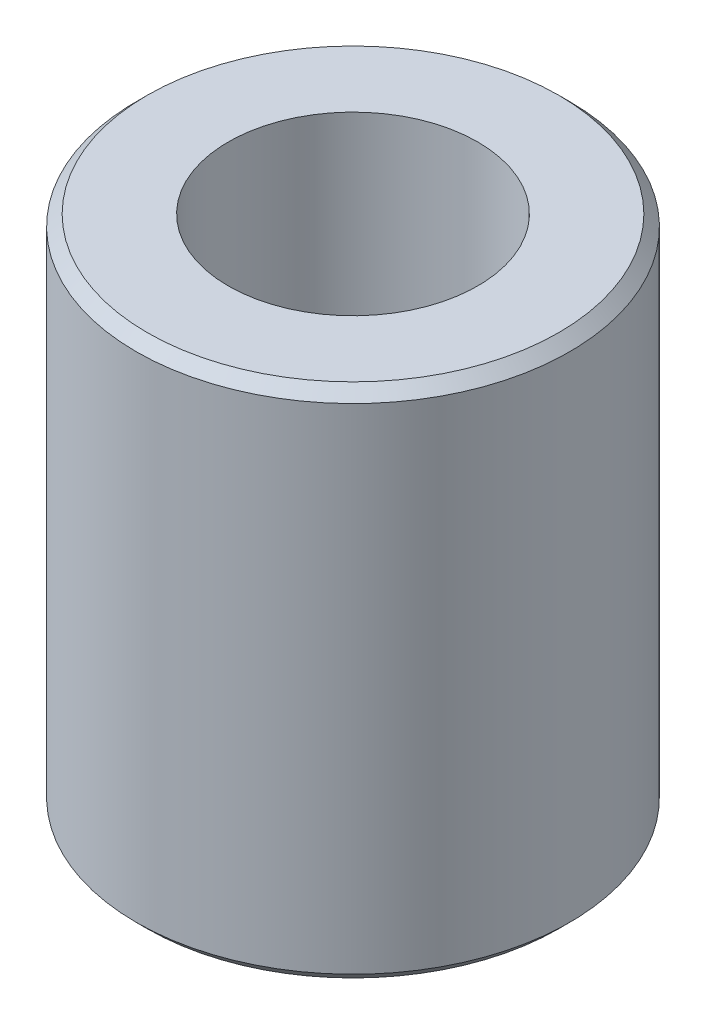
ISO-10303-21;
HEADER;
FILE_DESCRIPTION(('STEP AP214'),'2;1');
FILE_NAME('part.step','',(''),(''),'','','');
FILE_SCHEMA(('AUTOMOTIVE_DESIGN { 1 0 10303 214 1 1 1 1 }'));
ENDSEC;
DATA;
#1=APPLICATION_CONTEXT('core data for automotive mechanical design processes');
#2=APPLICATION_PROTOCOL_DEFINITION('international standard','automotive_design',2000,#1);
#3=PRODUCT_CONTEXT('',#1,'mechanical');
#4=PRODUCT('Part','Part','',(#3));
#5=PRODUCT_RELATED_PRODUCT_CATEGORY('part','',(#4));
#6=PRODUCT_DEFINITION_FORMATION('','',#4);
#7=PRODUCT_DEFINITION_CONTEXT('part definition',#1,'design');
#8=PRODUCT_DEFINITION('design','',#6,#7);
#9=PRODUCT_DEFINITION_SHAPE('','',#8);
#10=(LENGTH_UNIT() NAMED_UNIT(*) SI_UNIT(.MILLI.,.METRE.));
#11=(NAMED_UNIT(*) PLANE_ANGLE_UNIT() SI_UNIT($,.RADIAN.));
#12=(NAMED_UNIT(*) SI_UNIT($,.STERADIAN.) SOLID_ANGLE_UNIT());
#13=UNCERTAINTY_MEASURE_WITH_UNIT(LENGTH_MEASURE(1.E-05),#10,'distance_accuracy_value','');
#14=(GEOMETRIC_REPRESENTATION_CONTEXT(3) GLOBAL_UNCERTAINTY_ASSIGNED_CONTEXT((#13)) GLOBAL_UNIT_ASSIGNED_CONTEXT((#10,
#11,#12)) REPRESENTATION_CONTEXT('',''));
#15=CARTESIAN_POINT('',(0.,0.,0.));
#16=DIRECTION('',(0.,0.,1.));
#17=DIRECTION('',(1.,0.,0.));
#18=AXIS2_PLACEMENT_3D('',#15,#16,#17);
#19=CARTESIAN_POINT('',(0.,4.86357961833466,0.));
#20=DIRECTION('',(0.,1.,0.));
#21=DIRECTION('',(0.,0.,1.));
#22=AXIS2_PLACEMENT_3D('',#19,#20,#21);
#23=CYLINDRICAL_SURFACE('',#22,7.14375);
#24=CARTESIAN_POINT('',(0.,-11.1125,0.));
#25=DIRECTION('',(0.,1.,0.));
#26=DIRECTION('',(0.,0.,1.));
#27=AXIS2_PLACEMENT_3D('',#24,#25,#26);
#28=CIRCLE('',#27,7.14375);
#29=CARTESIAN_POINT('',(0.,-11.1125,7.14375));
#30=VERTEX_POINT('',#29);
#31=EDGE_CURVE('E207',#30,#30,#28,.T.);
#32=ORIENTED_EDGE('',*,*,#31,.T.);
#33=EDGE_LOOP('',(#32));
#34=FACE_BOUND('',#33,.T.);
#35=CARTESIAN_POINT('',(0.,-12.6873,0.));
#36=DIRECTION('',(0.,-1.,0.));
#37=DIRECTION('',(0.,0.,-1.));
#38=AXIS2_PLACEMENT_3D('',#35,#36,#37);
#39=CIRCLE('',#38,7.14375);
#40=CARTESIAN_POINT('',(0.,-12.6873,-7.14375));
#41=VERTEX_POINT('',#40);
#42=CARTESIAN_POINT('',(-6.18666897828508,-12.6873,-3.571875));
#43=VERTEX_POINT('',#42);
#44=EDGE_CURVE('E276',#41,#43,#39,.F.);
#45=ORIENTED_EDGE('',*,*,#44,.F.);
#46=CARTESIAN_POINT('',(6.18666897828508,-12.6873,-3.57187499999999));
#47=VERTEX_POINT('',#46);
#48=EDGE_CURVE('E54',#47,#41,#39,.F.);
#49=ORIENTED_EDGE('',*,*,#48,.F.);
#50=CARTESIAN_POINT('',(6.18666897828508,-12.6873,3.571875));
#51=VERTEX_POINT('',#50);
#52=EDGE_CURVE('E147',#51,#47,#39,.F.);
#53=ORIENTED_EDGE('',*,*,#52,.F.);
#54=CARTESIAN_POINT('',(0.,-12.6873,7.14375));
#55=VERTEX_POINT('',#54);
#56=EDGE_CURVE('E335',#55,#51,#39,.F.);
#57=ORIENTED_EDGE('',*,*,#56,.F.);
#58=CARTESIAN_POINT('',(-6.18666897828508,-12.6873,3.57187499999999));
#59=VERTEX_POINT('',#58);
#60=EDGE_CURVE('E332',#59,#55,#39,.F.);
#61=ORIENTED_EDGE('',*,*,#60,.F.);
#62=EDGE_CURVE('E329',#43,#59,#39,.F.);
#63=ORIENTED_EDGE('',*,*,#62,.F.);
#64=EDGE_LOOP('',(#45,#49,#53,#57,#61,#63));
#65=FACE_BOUND('',#64,.T.);
#66=ADVANCED_FACE('F35',(#34,#65),#23,.F.);
#67=CARTESIAN_POINT('',(0.,-23.8125,0.));
#68=DIRECTION('',(0.,-1.,0.));
#69=DIRECTION('',(0.,0.,-1.));
#70=AXIS2_PLACEMENT_3D('',#67,#68,#69);
#71=CONICAL_SURFACE('',#70,8.15975,0.785398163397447);
#72=CARTESIAN_POINT('',(4.21489186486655,-23.8127000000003,-6.98709314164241));
#73=CARTESIAN_POINT('',(4.28318413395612,-23.7467000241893,-6.86880746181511));
#74=CARTESIAN_POINT('',(4.35198830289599,-23.6828153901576,-6.74963514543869));
#75=CARTESIAN_POINT('',(4.4907083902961,-23.5598853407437,-6.50936490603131));
#76=CARTESIAN_POINT('',(4.56062484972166,-23.5008423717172,-6.38826604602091));
#77=CARTESIAN_POINT('',(4.77273544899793,-23.3314558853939,-6.02087971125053));
#78=CARTESIAN_POINT('',(4.91664778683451,-23.2294895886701,-5.77161623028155));
#79=CARTESIAN_POINT('',(5.20678485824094,-23.0553604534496,-5.26908408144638));
#80=CARTESIAN_POINT('',(5.35294684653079,-22.9827912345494,-5.01592409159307));
#81=CARTESIAN_POINT('',(5.57439985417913,-22.8992395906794,-4.63235623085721));
#82=CARTESIAN_POINT('',(5.64852180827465,-22.8756154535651,-4.50397324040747));
#83=CARTESIAN_POINT('',(5.79733557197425,-22.8372971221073,-4.24622024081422));
#84=CARTESIAN_POINT('',(5.87202731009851,-22.8226018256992,-4.11685035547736));
#85=CARTESIAN_POINT('',(6.0585174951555,-22.7976320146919,-3.79383987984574));
#86=CARTESIAN_POINT('',(6.170521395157,-22.7930745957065,-3.59984343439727));
#87=CARTESIAN_POINT('',(6.394269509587,-22.8050554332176,-3.21230033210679));
#88=CARTESIAN_POINT('',(6.50601362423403,-22.8216007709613,-3.01875384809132));
#89=CARTESIAN_POINT('',(6.728384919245,-22.8748115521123,-2.63359546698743));
#90=CARTESIAN_POINT('',(6.83901095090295,-22.9114958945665,-2.44198555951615));
#91=CARTESIAN_POINT('',(7.05833575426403,-23.0030104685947,-2.0621038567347));
#92=CARTESIAN_POINT('',(7.1670346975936,-23.0578390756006,-1.87383176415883));
#93=CARTESIAN_POINT('',(7.3507423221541,-23.164884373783,-1.55564082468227));
#94=CARTESIAN_POINT('',(7.42633160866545,-23.2131998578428,-1.42471633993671));
#95=CARTESIAN_POINT('',(7.57629860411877,-23.3167990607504,-1.16496588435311));
#96=CARTESIAN_POINT('',(7.65067640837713,-23.3720822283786,-1.03613974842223));
#97=CARTESIAN_POINT('',(7.79797567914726,-23.4885739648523,-0.781009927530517));
#98=CARTESIAN_POINT('',(7.87090107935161,-23.5497627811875,-0.654699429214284));
#99=CARTESIAN_POINT('',(8.01555501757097,-23.6774410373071,-0.404151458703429));
#100=CARTESIAN_POINT('',(8.08728395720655,-23.7439286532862,-0.279913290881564));
#101=CARTESIAN_POINT('',(8.15844609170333,-23.8127,-0.156656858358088));
#102=B_SPLINE_CURVE_WITH_KNOTS('',3,(#72,#73,#74,#75,#76,#77,#78,#79,#80,#81,#82,#83,#84,#85,
#86,#87,#88,#89,#90,#91,#92,#93,#94,#95,#96,#97,#98,#99,#100,#101),.UNSPECIFIED.,.F.,.F.,(4,2,2,
2,2,2,2,2,2,2,2,2,2,2,4),(0.,0.455057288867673,0.910343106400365,1.82520649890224,
2.72695188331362,3.17705869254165,3.62710993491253,4.29822549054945,4.96956630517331,
5.64153820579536,6.31344995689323,6.7894154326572,7.26534327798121,7.73973109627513,
8.21395633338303),.UNSPECIFIED.);
#103=CARTESIAN_POINT('',(4.21509879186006,-23.8125,-6.98673473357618));
#104=VERTEX_POINT('',#103);
#105=CARTESIAN_POINT('',(8.1582391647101,-23.8125,-0.157015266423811));
#106=VERTEX_POINT('',#105);
#107=EDGE_CURVE('E263',#104,#106,#102,.T.);
#108=ORIENTED_EDGE('',*,*,#107,.F.);
#109=CARTESIAN_POINT('',(0.,-23.8125,0.));
#110=DIRECTION('',(0.,-1.,0.));
#111=DIRECTION('',(0.,0.,-1.));
#112=AXIS2_PLACEMENT_3D('',#109,#110,#111);
#113=CIRCLE('',#112,8.15975);
#114=EDGE_CURVE('E230',#106,#104,#113,.F.);
#115=ORIENTED_EDGE('',*,*,#114,.F.);
#116=EDGE_LOOP('',(#108,#115));
#117=FACE_BOUND('',#116,.T.);
#118=ADVANCED_FACE('F317',(#117),#71,.F.);
#119=CARTESIAN_POINT('',(-8.57143643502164,-26.810827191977,-7.14375));
#120=CARTESIAN_POINT('',(-8.36421525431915,-26.6516793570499,-7.14375));
#121=CARTESIAN_POINT('',(-8.15587345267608,-26.4939676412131,-7.14375));
#122=CARTESIAN_POINT('',(-7.73649203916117,-26.1820713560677,-7.14375));
#123=CARTESIAN_POINT('',(-7.52545179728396,-26.0278876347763,-7.14375));
#124=CARTESIAN_POINT('',(-7.09867432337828,-25.722604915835,-7.14375));
#125=CARTESIAN_POINT('',(-6.88291340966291,-25.5715389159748,-7.14375));
#126=CARTESIAN_POINT('',(-6.44779370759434,-25.2746982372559,-7.14375));
#127=CARTESIAN_POINT('',(-6.22843516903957,-25.1289231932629,-7.14375));
#128=CARTESIAN_POINT('',(-5.77160686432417,-24.8349140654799,-7.14375));
#129=CARTESIAN_POINT('',(-5.53386496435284,-24.6871006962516,-7.14375));
#130=CARTESIAN_POINT('',(-5.05280058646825,-24.4006979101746,-7.14375));
#131=CARTESIAN_POINT('',(-4.80947718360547,-24.2621100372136,-7.14375));
#132=CARTESIAN_POINT('',(-4.31719150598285,-23.9971133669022,-7.14375));
#133=CARTESIAN_POINT('',(-4.06824863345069,-23.8706688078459,-7.14375));
#134=CARTESIAN_POINT('',(-3.5633478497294,-23.6327915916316,-7.14375));
#135=CARTESIAN_POINT('',(-3.30739330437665,-23.5213518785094,-7.14375));
#136=CARTESIAN_POINT('',(-2.81313691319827,-23.3274103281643,-7.14375));
#137=CARTESIAN_POINT('',(-2.57553227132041,-23.2431497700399,-7.14375));
#138=CARTESIAN_POINT('',(-2.09430022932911,-23.0936506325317,-7.14375));
#139=CARTESIAN_POINT('',(-1.8506724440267,-23.028413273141,-7.14375));
#140=CARTESIAN_POINT('',(-1.36307394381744,-22.9215668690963,-7.14375));
#141=CARTESIAN_POINT('',(-1.1191983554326,-22.8795309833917,-7.14375));
#142=CARTESIAN_POINT('',(-0.62845641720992,-22.8199592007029,-7.14375));
#143=CARTESIAN_POINT('',(-0.381590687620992,-22.8024183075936,-7.14375));
#144=CARTESIAN_POINT('',(0.102009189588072,-22.7933130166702,-7.14375));
#145=CARTESIAN_POINT('',(0.338723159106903,-22.8006654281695,-7.14375));
#146=CARTESIAN_POINT('',(0.810287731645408,-22.8384622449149,-7.14375));
#147=CARTESIAN_POINT('',(1.04513816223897,-22.8689087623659,-7.14375));
#148=CARTESIAN_POINT('',(1.51525493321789,-22.9516954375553,-7.14375));
#149=CARTESIAN_POINT('',(1.75045228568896,-23.0044208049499,-7.14375));
#150=CARTESIAN_POINT('',(2.21567323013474,-23.128850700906,-7.14375));
#151=CARTESIAN_POINT('',(2.44569712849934,-23.2005541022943,-7.14375));
#152=CARTESIAN_POINT('',(2.91395182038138,-23.3646418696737,-7.14375));
#153=CARTESIAN_POINT('',(3.15183083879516,-23.4580188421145,-7.14375));
#154=CARTESIAN_POINT('',(3.62146559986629,-23.6591920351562,-7.14375));
#155=CARTESIAN_POINT('',(3.85321851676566,-23.7669947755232,-7.14375));
#156=CARTESIAN_POINT('',(4.31169859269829,-23.9944624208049,-7.14375));
#157=CARTESIAN_POINT('',(4.53840744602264,-24.1141639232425,-7.14375));
#158=CARTESIAN_POINT('',(4.98662849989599,-24.3627939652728,-7.14375));
#159=CARTESIAN_POINT('',(5.20814149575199,-24.4917210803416,-7.14375));
#160=CARTESIAN_POINT('',(5.63581912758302,-24.7504470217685,-7.14375));
#161=CARTESIAN_POINT('',(5.84220135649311,-24.8798880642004,-7.14374999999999));
#162=CARTESIAN_POINT('',(6.25142018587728,-25.1442747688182,-7.14374999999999));
#163=CARTESIAN_POINT('',(6.45425651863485,-25.279220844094,-7.14374999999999));
#164=CARTESIAN_POINT('',(6.85521548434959,-25.5525358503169,-7.14374999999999));
#165=CARTESIAN_POINT('',(7.05336289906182,-25.6908685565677,-7.14374999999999));
#166=CARTESIAN_POINT('',(7.44694018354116,-25.9712383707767,-7.14374999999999));
#167=CARTESIAN_POINT('',(7.64237078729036,-26.1132744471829,-7.14374999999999));
#168=CARTESIAN_POINT('',(7.83666188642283,-26.2568262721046,-7.14374999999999));
#169=B_SPLINE_CURVE_WITH_KNOTS('',3,(#119,#120,#121,#122,#123,#124,#125,#126,#127,#128,#129,
#130,#131,#132,#133,#134,#135,#136,#137,#138,#139,#140,#141,#142,#143,#144,#145,#146,#147,#148,
#149,#150,#151,#152,#153,#154,#155,#156,#157,#158,#159,#160,#161,#162,#163,#164,#165,#166,#167,
#168),.UNSPECIFIED.,.F.,.F.,(4,2,2,2,2,2,2,2,2,2,2,2,2,2,2,2,2,2,2,2,2,2,2,2,4),(0.,
0.783862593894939,1.56791166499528,2.35801282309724,3.14805935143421,3.98773220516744,
4.82754522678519,5.66480387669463,6.50166742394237,7.25732280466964,8.01302663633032,
8.75432013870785,9.49546242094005,10.2047769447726,10.9141563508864,11.6363383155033,
12.3584773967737,13.1245385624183,13.8909471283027,14.6597905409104,15.4285154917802,
16.1592601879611,16.8900598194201,17.614986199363,18.3397127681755),.UNSPECIFIED.);
#170=CARTESIAN_POINT('',(-3.94314037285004,-23.8125,-7.14375));
#171=VERTEX_POINT('',#170);
#172=CARTESIAN_POINT('',(3.94314037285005,-23.8125,-7.14375));
#173=VERTEX_POINT('',#172);
#174=EDGE_CURVE('E269',#171,#173,#169,.T.);
#175=ORIENTED_EDGE('',*,*,#174,.F.);
#176=EDGE_CURVE('E225',#173,#171,#113,.F.);
#177=ORIENTED_EDGE('',*,*,#176,.F.);
#178=EDGE_LOOP('',(#175,#177));
#179=FACE_BOUND('',#178,.T.);
#180=ADVANCED_FACE('F322',(#179),#71,.F.);
#181=CARTESIAN_POINT('',(-8.15844609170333,-23.8127,-0.156656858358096));
#182=CARTESIAN_POINT('',(-8.09015382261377,-23.746700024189,-0.274942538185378));
#183=CARTESIAN_POINT('',(-8.0213496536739,-23.6828153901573,-0.394114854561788));
#184=CARTESIAN_POINT('',(-7.88262956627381,-23.5598853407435,-0.634385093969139));
#185=CARTESIAN_POINT('',(-7.81271310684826,-23.500842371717,-0.75548395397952));
#186=CARTESIAN_POINT('',(-7.60060250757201,-23.3314558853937,-1.12287028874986));
#187=CARTESIAN_POINT('',(-7.45669016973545,-23.22948958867,-1.37213376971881));
#188=CARTESIAN_POINT('',(-7.16655309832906,-23.0553604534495,-1.87466591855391));
#189=CARTESIAN_POINT('',(-7.02039111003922,-22.9827912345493,-2.12782590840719));
#190=CARTESIAN_POINT('',(-6.79893810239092,-22.8992395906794,-2.511393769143));
#191=CARTESIAN_POINT('',(-6.7248161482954,-22.875615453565,-2.63977675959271));
#192=CARTESIAN_POINT('',(-6.57600238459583,-22.8372971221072,-2.89752975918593));
#193=CARTESIAN_POINT('',(-6.50131064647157,-22.8226018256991,-3.02689964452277));
#194=CARTESIAN_POINT('',(-6.31482046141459,-22.7976320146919,-3.34991012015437));
#195=CARTESIAN_POINT('',(-6.20281656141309,-22.7930745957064,-3.54390656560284));
#196=CARTESIAN_POINT('',(-5.9790684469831,-22.8050554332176,-3.93144966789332));
#197=CARTESIAN_POINT('',(-5.86732433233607,-22.8216007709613,-4.12499615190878));
#198=CARTESIAN_POINT('',(-5.6449530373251,-22.8748115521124,-4.51015453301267));
#199=CARTESIAN_POINT('',(-5.53432700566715,-22.9114958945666,-4.70176444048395));
#200=CARTESIAN_POINT('',(-5.31500220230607,-23.0030104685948,-5.0816461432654));
#201=CARTESIAN_POINT('',(-5.2063032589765,-23.0578390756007,-5.26991823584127));
#202=CARTESIAN_POINT('',(-5.02259563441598,-23.164884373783,-5.58810917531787));
#203=CARTESIAN_POINT('',(-4.94700634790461,-23.2131998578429,-5.71903366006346));
#204=CARTESIAN_POINT('',(-4.79703935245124,-23.3167990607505,-5.97878411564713));
#205=CARTESIAN_POINT('',(-4.72266154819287,-23.3720822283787,-6.10761025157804));
#206=CARTESIAN_POINT('',(-4.5753622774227,-23.4885739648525,-6.36274007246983));
#207=CARTESIAN_POINT('',(-4.50243687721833,-23.5497627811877,-6.48905057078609));
#208=CARTESIAN_POINT('',(-4.35778293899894,-23.6774410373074,-6.73959854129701));
#209=CARTESIAN_POINT('',(-4.28605399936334,-23.7439286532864,-6.86383670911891));
#210=CARTESIAN_POINT('',(-4.21489186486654,-23.8127000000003,-6.98709314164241));
#211=B_SPLINE_CURVE_WITH_KNOTS('',3,(#181,#182,#183,#184,#185,#186,#187,#188,#189,#190,#191,
#192,#193,#194,#195,#196,#197,#198,#199,#200,#201,#202,#203,#204,#205,#206,#207,#208,#209,#210),
.UNSPECIFIED.,.F.,.F.,(4,2,2,2,2,2,2,2,2,2,2,2,2,2,4),(0.,0.45505728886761,0.910343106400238,
1.82520649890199,2.72695188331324,3.1770586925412,3.62710993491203,4.29822549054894,
4.96956630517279,5.64153820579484,6.31344995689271,6.78941543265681,7.26534327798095,
7.73973109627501,8.21395633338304),.UNSPECIFIED.);
#212=CARTESIAN_POINT('',(-8.15823916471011,-23.8125,-0.15701526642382));
#213=VERTEX_POINT('',#212);
#214=CARTESIAN_POINT('',(-4.21509879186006,-23.8125,-6.98673473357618));
#215=VERTEX_POINT('',#214);
#216=EDGE_CURVE('E402',#213,#215,#211,.T.);
#217=ORIENTED_EDGE('',*,*,#216,.F.);
#218=EDGE_CURVE('E231',#215,#213,#113,.F.);
#219=ORIENTED_EDGE('',*,*,#218,.F.);
#220=EDGE_LOOP('',(#217,#219));
#221=FACE_BOUND('',#220,.T.);
#222=ADVANCED_FACE('F383',(#221),#71,.F.);
#223=CARTESIAN_POINT('',(-4.21489186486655,-23.8127000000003,6.98709314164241));
#224=CARTESIAN_POINT('',(-4.28318413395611,-23.7467000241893,6.86880746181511));
#225=CARTESIAN_POINT('',(-4.35198830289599,-23.6828153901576,6.74963514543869));
#226=CARTESIAN_POINT('',(-4.4907083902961,-23.5598853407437,6.50936490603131));
#227=CARTESIAN_POINT('',(-4.56062484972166,-23.5008423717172,6.38826604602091));
#228=CARTESIAN_POINT('',(-4.77273544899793,-23.3314558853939,6.02087971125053));
#229=CARTESIAN_POINT('',(-4.91664778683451,-23.2294895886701,5.77161623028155));
#230=CARTESIAN_POINT('',(-5.20678485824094,-23.0553604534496,5.26908408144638));
#231=CARTESIAN_POINT('',(-5.35294684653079,-22.9827912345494,5.01592409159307));
#232=CARTESIAN_POINT('',(-5.57439985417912,-22.8992395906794,4.63235623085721));
#233=CARTESIAN_POINT('',(-5.64852180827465,-22.8756154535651,4.50397324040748));
#234=CARTESIAN_POINT('',(-5.79733557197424,-22.8372971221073,4.24622024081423));
#235=CARTESIAN_POINT('',(-5.87202731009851,-22.8226018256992,4.11685035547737));
#236=CARTESIAN_POINT('',(-6.0585174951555,-22.7976320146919,3.79383987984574));
#237=CARTESIAN_POINT('',(-6.170521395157,-22.7930745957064,3.59984343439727));
#238=CARTESIAN_POINT('',(-6.39426950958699,-22.8050554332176,3.2123003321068));
#239=CARTESIAN_POINT('',(-6.50601362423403,-22.8216007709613,3.01875384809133));
#240=CARTESIAN_POINT('',(-6.728384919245,-22.8748115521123,2.63359546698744));
#241=CARTESIAN_POINT('',(-6.83901095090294,-22.9114958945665,2.44198555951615));
#242=CARTESIAN_POINT('',(-7.05833575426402,-23.0030104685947,2.06210385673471));
#243=CARTESIAN_POINT('',(-7.1670346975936,-23.0578390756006,1.87383176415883));
#244=CARTESIAN_POINT('',(-7.35074232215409,-23.164884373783,1.55564082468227));
#245=CARTESIAN_POINT('',(-7.42633160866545,-23.2131998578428,1.42471633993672));
#246=CARTESIAN_POINT('',(-7.57629860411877,-23.3167990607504,1.16496588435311));
#247=CARTESIAN_POINT('',(-7.65067640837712,-23.3720822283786,1.03613974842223));
#248=CARTESIAN_POINT('',(-7.79797567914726,-23.4885739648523,0.781009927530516));
#249=CARTESIAN_POINT('',(-7.87090107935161,-23.5497627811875,0.654699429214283));
#250=CARTESIAN_POINT('',(-8.01555501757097,-23.6774410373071,0.404151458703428));
#251=CARTESIAN_POINT('',(-8.08728395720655,-23.7439286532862,0.279913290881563));
#252=CARTESIAN_POINT('',(-8.15844609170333,-23.8127,0.156656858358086));
#253=B_SPLINE_CURVE_WITH_KNOTS('',3,(#223,#224,#225,#226,#227,#228,#229,#230,#231,#232,#233,
#234,#235,#236,#237,#238,#239,#240,#241,#242,#243,#244,#245,#246,#247,#248,#249,#250,#251,#252),
.UNSPECIFIED.,.F.,.F.,(4,2,2,2,2,2,2,2,2,2,2,2,2,2,4),(0.,0.455057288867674,0.910343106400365,
1.82520649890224,2.72695188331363,3.17705869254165,3.62710993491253,4.29822549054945,
4.9695663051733,5.64153820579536,6.31344995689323,6.7894154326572,7.26534327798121,
7.73973109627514,8.21395633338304),.UNSPECIFIED.);
#254=CARTESIAN_POINT('',(-4.21509879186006,-23.8125,6.98673473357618));
#255=VERTEX_POINT('',#254);
#256=CARTESIAN_POINT('',(-8.1582391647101,-23.8125,0.15701526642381));
#257=VERTEX_POINT('',#256);
#258=EDGE_CURVE('E389',#255,#257,#253,.T.);
#259=ORIENTED_EDGE('',*,*,#258,.F.);
#260=EDGE_CURVE('E392',#257,#255,#113,.F.);
#261=ORIENTED_EDGE('',*,*,#260,.F.);
#262=EDGE_LOOP('',(#259,#261));
#263=FACE_BOUND('',#262,.T.);
#264=ADVANCED_FACE('F377',(#263),#71,.F.);
#265=CARTESIAN_POINT('',(-8.57143643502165,-26.810827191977,7.14375));
#266=CARTESIAN_POINT('',(-8.36421525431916,-26.6516793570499,7.14375));
#267=CARTESIAN_POINT('',(-8.15587345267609,-26.4939676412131,7.14375));
#268=CARTESIAN_POINT('',(-7.73649203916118,-26.1820713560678,7.14375));
#269=CARTESIAN_POINT('',(-7.52545179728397,-26.0278876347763,7.14375));
#270=CARTESIAN_POINT('',(-7.09867432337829,-25.722604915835,7.14375));
#271=CARTESIAN_POINT('',(-6.88291340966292,-25.5715389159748,7.14375));
#272=CARTESIAN_POINT('',(-6.44779370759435,-25.2746982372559,7.14375));
#273=CARTESIAN_POINT('',(-6.22843516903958,-25.1289231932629,7.14375));
#274=CARTESIAN_POINT('',(-5.77160686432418,-24.8349140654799,7.14375));
#275=CARTESIAN_POINT('',(-5.53386496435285,-24.6871006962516,7.14375));
#276=CARTESIAN_POINT('',(-5.05280058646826,-24.4006979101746,7.14375));
#277=CARTESIAN_POINT('',(-4.80947718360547,-24.2621100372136,7.14375));
#278=CARTESIAN_POINT('',(-4.31719150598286,-23.9971133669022,7.14375));
#279=CARTESIAN_POINT('',(-4.06824863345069,-23.8706688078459,7.14375));
#280=CARTESIAN_POINT('',(-3.5633478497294,-23.6327915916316,7.14375));
#281=CARTESIAN_POINT('',(-3.30739330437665,-23.5213518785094,7.14375));
#282=CARTESIAN_POINT('',(-2.81313691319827,-23.3274103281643,7.14375));
#283=CARTESIAN_POINT('',(-2.57553227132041,-23.2431497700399,7.14375));
#284=CARTESIAN_POINT('',(-2.09430022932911,-23.0936506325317,7.14375));
#285=CARTESIAN_POINT('',(-1.8506724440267,-23.028413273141,7.14375));
#286=CARTESIAN_POINT('',(-1.36307394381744,-22.9215668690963,7.14375));
#287=CARTESIAN_POINT('',(-1.1191983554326,-22.8795309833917,7.14375));
#288=CARTESIAN_POINT('',(-0.628456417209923,-22.8199592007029,7.14375));
#289=CARTESIAN_POINT('',(-0.381590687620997,-22.8024183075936,7.14375));
#290=CARTESIAN_POINT('',(0.102009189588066,-22.7933130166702,7.14375));
#291=CARTESIAN_POINT('',(0.338723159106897,-22.8006654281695,7.14375));
#292=CARTESIAN_POINT('',(0.810287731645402,-22.8384622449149,7.14375));
#293=CARTESIAN_POINT('',(1.04513816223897,-22.8689087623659,7.14375));
#294=CARTESIAN_POINT('',(1.51525493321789,-22.9516954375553,7.14375));
#295=CARTESIAN_POINT('',(1.75045228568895,-23.0044208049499,7.14375));
#296=CARTESIAN_POINT('',(2.21567323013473,-23.128850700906,7.14375));
#297=CARTESIAN_POINT('',(2.44569712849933,-23.2005541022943,7.14375));
#298=CARTESIAN_POINT('',(2.91395182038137,-23.3646418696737,7.14375));
#299=CARTESIAN_POINT('',(3.15183083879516,-23.4580188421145,7.14375));
#300=CARTESIAN_POINT('',(3.62146559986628,-23.6591920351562,7.14375));
#301=CARTESIAN_POINT('',(3.85321851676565,-23.7669947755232,7.14375));
#302=CARTESIAN_POINT('',(4.31169859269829,-23.9944624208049,7.14375));
#303=CARTESIAN_POINT('',(4.53840744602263,-24.1141639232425,7.14375));
#304=CARTESIAN_POINT('',(4.98662849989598,-24.3627939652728,7.14375));
#305=CARTESIAN_POINT('',(5.20814149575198,-24.4917210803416,7.14375));
#306=CARTESIAN_POINT('',(5.63581912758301,-24.7504470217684,7.14375));
#307=CARTESIAN_POINT('',(5.8422013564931,-24.8798880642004,7.14375));
#308=CARTESIAN_POINT('',(6.25142018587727,-25.1442747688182,7.14375));
#309=CARTESIAN_POINT('',(6.45425651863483,-25.279220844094,7.14375));
#310=CARTESIAN_POINT('',(6.85521548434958,-25.5525358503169,7.14375));
#311=CARTESIAN_POINT('',(7.05336289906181,-25.6908685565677,7.14375));
#312=CARTESIAN_POINT('',(7.44694018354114,-25.9712383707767,7.14375));
#313=CARTESIAN_POINT('',(7.64237078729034,-26.1132744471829,7.14375));
#314=CARTESIAN_POINT('',(7.83666188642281,-26.2568262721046,7.14375));
#315=B_SPLINE_CURVE_WITH_KNOTS('',3,(#265,#266,#267,#268,#269,#270,#271,#272,#273,#274,#275,
#276,#277,#278,#279,#280,#281,#282,#283,#284,#285,#286,#287,#288,#289,#290,#291,#292,#293,#294,
#295,#296,#297,#298,#299,#300,#301,#302,#303,#304,#305,#306,#307,#308,#309,#310,#311,#312,#313,
#314),.UNSPECIFIED.,.F.,.F.,(4,2,2,2,2,2,2,2,2,2,2,2,2,2,2,2,2,2,2,2,2,2,2,2,4),(0.,
0.783862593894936,1.56791166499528,2.35801282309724,3.14805935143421,3.98773220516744,
4.8275452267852,5.66480387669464,6.50166742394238,7.25732280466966,8.01302663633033,
8.75432013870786,9.49546242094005,10.2047769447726,10.9141563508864,11.6363383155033,
12.3584773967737,13.1245385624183,13.8909471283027,14.6597905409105,15.4285154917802,
16.1592601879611,16.8900598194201,17.614986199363,18.3397127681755),.UNSPECIFIED.);
#316=CARTESIAN_POINT('',(3.94314037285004,-23.8125,7.14375));
#317=VERTEX_POINT('',#316);
#318=CARTESIAN_POINT('',(-3.94314037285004,-23.8125,7.14375));
#319=VERTEX_POINT('',#318);
#320=EDGE_CURVE('E239',#317,#319,#315,.F.);
#321=ORIENTED_EDGE('',*,*,#320,.F.);
#322=EDGE_CURVE('E387',#319,#317,#113,.F.);
#323=ORIENTED_EDGE('',*,*,#322,.F.);
#324=EDGE_LOOP('',(#321,#323));
#325=FACE_BOUND('',#324,.T.);
#326=ADVANCED_FACE('F373',(#325),#71,.F.);
#327=CARTESIAN_POINT('',(0.,-23.8125,0.));
#328=DIRECTION('',(0.,-1.,0.));
#329=DIRECTION('',(0.,0.,-1.));
#330=AXIS2_PLACEMENT_3D('',#327,#328,#329);
#331=PLANE('',#330);
#332=CARTESIAN_POINT('',(0.,-23.8125,0.));
#333=DIRECTION('',(0.,-1.,0.));
#334=DIRECTION('',(0.,0.,-1.));
#335=AXIS2_PLACEMENT_3D('',#332,#333,#334);
#336=CIRCLE('',#335,9.48689999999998);
#337=CARTESIAN_POINT('',(0.,-23.8125,-9.48689999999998));
#338=VERTEX_POINT('',#337);
#339=EDGE_CURVE('E43',#338,#338,#336,.T.);
#340=ORIENTED_EDGE('',*,*,#339,.T.);
#341=EDGE_LOOP('',(#340));
#342=FACE_BOUND('',#341,.T.);
#343=DIRECTION('',(0.499999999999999,0.,0.866025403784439));
#344=VECTOR('',#343,1.);
#345=CARTESIAN_POINT('',(4.12444598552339,-23.8125,-7.14375));
#346=LINE('',#345,#344);
#347=CARTESIAN_POINT('',(4.12444598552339,-23.8125,-7.14375));
#348=VERTEX_POINT('',#347);
#349=EDGE_CURVE('E183',#348,#104,#346,.T.);
#350=ORIENTED_EDGE('',*,*,#349,.F.);
#351=DIRECTION('',(1.,0.,0.));
#352=VECTOR('',#351,1.);
#353=CARTESIAN_POINT('',(-4.12444598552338,-23.8125,-7.14375));
#354=LINE('',#353,#352);
#355=EDGE_CURVE('E201',#173,#348,#354,.T.);
#356=ORIENTED_EDGE('',*,*,#355,.F.);
#357=ORIENTED_EDGE('',*,*,#176,.T.);
#358=CARTESIAN_POINT('',(-4.12444598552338,-23.8125,-7.14375));
#359=VERTEX_POINT('',#358);
#360=EDGE_CURVE('E149',#359,#171,#354,.T.);
#361=ORIENTED_EDGE('',*,*,#360,.F.);
#362=DIRECTION('',(0.5,0.,-0.866025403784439));
#363=VECTOR('',#362,1.);
#364=CARTESIAN_POINT('',(-8.24889197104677,-23.8125,0.));
#365=LINE('',#364,#363);
#366=EDGE_CURVE('E197',#215,#359,#365,.T.);
#367=ORIENTED_EDGE('',*,*,#366,.F.);
#368=ORIENTED_EDGE('',*,*,#218,.T.);
#369=CARTESIAN_POINT('',(-8.24889197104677,-23.8125,0.));
#370=VERTEX_POINT('',#369);
#371=EDGE_CURVE('E198',#370,#213,#365,.T.);
#372=ORIENTED_EDGE('',*,*,#371,.F.);
#373=DIRECTION('',(-0.499999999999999,0.,-0.866025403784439));
#374=VECTOR('',#373,1.);
#375=CARTESIAN_POINT('',(-4.12444598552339,-23.8125,7.14375));
#376=LINE('',#375,#374);
#377=EDGE_CURVE('E193',#257,#370,#376,.T.);
#378=ORIENTED_EDGE('',*,*,#377,.F.);
#379=ORIENTED_EDGE('',*,*,#260,.T.);
#380=CARTESIAN_POINT('',(-4.12444598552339,-23.8125,7.14375));
#381=VERTEX_POINT('',#380);
#382=EDGE_CURVE('E194',#381,#255,#376,.T.);
#383=ORIENTED_EDGE('',*,*,#382,.F.);
#384=DIRECTION('',(-1.,0.,0.));
#385=VECTOR('',#384,1.);
#386=CARTESIAN_POINT('',(4.12444598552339,-23.8125,7.14375));
#387=LINE('',#386,#385);
#388=EDGE_CURVE('E189',#319,#381,#387,.T.);
#389=ORIENTED_EDGE('',*,*,#388,.F.);
#390=ORIENTED_EDGE('',*,*,#322,.T.);
#391=CARTESIAN_POINT('',(4.12444598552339,-23.8125,7.14375));
#392=VERTEX_POINT('',#391);
#393=EDGE_CURVE('E190',#392,#317,#387,.T.);
#394=ORIENTED_EDGE('',*,*,#393,.F.);
#395=DIRECTION('',(-0.5,0.,0.866025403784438));
#396=VECTOR('',#395,1.);
#397=CARTESIAN_POINT('',(8.24889197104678,-23.8125,0.));
#398=LINE('',#397,#396);
#399=CARTESIAN_POINT('',(4.21509879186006,-23.8125,6.98673473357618));
#400=VERTEX_POINT('',#399);
#401=EDGE_CURVE('E186',#400,#392,#398,.T.);
#402=ORIENTED_EDGE('',*,*,#401,.F.);
#403=CARTESIAN_POINT('',(8.15823916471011,-23.8125,0.157015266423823));
#404=VERTEX_POINT('',#403);
#405=EDGE_CURVE('E393',#400,#404,#113,.F.);
#406=ORIENTED_EDGE('',*,*,#405,.T.);
#407=CARTESIAN_POINT('',(8.24889197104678,-23.8125,0.));
#408=VERTEX_POINT('',#407);
#409=EDGE_CURVE('E187',#408,#404,#398,.T.);
#410=ORIENTED_EDGE('',*,*,#409,.F.);
#411=EDGE_CURVE('E155',#106,#408,#346,.T.);
#412=ORIENTED_EDGE('',*,*,#411,.F.);
#413=ORIENTED_EDGE('',*,*,#114,.T.);
#414=EDGE_LOOP('',(#350,#356,#357,#361,#367,#368,#372,#378,#379,#383,#389,#390,#394,#402,#406,
#410,#412,#413));
#415=FACE_BOUND('',#414,.T.);
#416=ADVANCED_FACE('F285',(#342,#415),#331,.T.);
#417=CARTESIAN_POINT('',(0.,12.4902148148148,0.));
#418=DIRECTION('',(0.,1.,0.));
#419=DIRECTION('',(0.,0.,1.));
#420=AXIS2_PLACEMENT_3D('',#417,#418,#419);
#421=CYLINDRICAL_SURFACE('',#420,9.9949);
#422=CARTESIAN_POINT('',(0.,-23.3045,0.));
#423=DIRECTION('',(0.,-1.,0.));
#424=DIRECTION('',(0.,0.,-1.));
#425=AXIS2_PLACEMENT_3D('',#422,#423,#424);
#426=CIRCLE('',#425,9.9949);
#427=CARTESIAN_POINT('',(0.,-23.3045,-9.9949));
#428=VERTEX_POINT('',#427);
#429=EDGE_CURVE('E280',#428,#428,#426,.F.);
#430=ORIENTED_EDGE('',*,*,#429,.T.);
#431=EDGE_LOOP('',(#430));
#432=FACE_BOUND('',#431,.T.);
#433=CARTESIAN_POINT('',(0.,-0.508000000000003,0.));
#434=DIRECTION('',(0.,1.,0.));
#435=DIRECTION('',(0.,0.,1.));
#436=AXIS2_PLACEMENT_3D('',#433,#434,#435);
#437=CIRCLE('',#436,9.9949);
#438=CARTESIAN_POINT('',(0.,-0.508000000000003,9.9949));
#439=VERTEX_POINT('',#438);
#440=EDGE_CURVE('E277',#439,#439,#437,.F.);
#441=ORIENTED_EDGE('',*,*,#440,.T.);
#442=EDGE_LOOP('',(#441));
#443=FACE_BOUND('',#442,.T.);
#444=ADVANCED_FACE('F292',(#432,#443),#421,.T.);
#445=CARTESIAN_POINT('',(0.,0.,0.));
#446=DIRECTION('',(0.,1.,0.));
#447=DIRECTION('',(0.,0.,1.));
#448=AXIS2_PLACEMENT_3D('',#445,#446,#447);
#449=PLANE('',#448);
#450=CARTESIAN_POINT('',(0.,0.,0.));
#451=DIRECTION('',(0.,1.,0.));
#452=DIRECTION('',(0.,0.,1.));
#453=AXIS2_PLACEMENT_3D('',#450,#451,#452);
#454=CIRCLE('',#453,9.4869);
#455=CARTESIAN_POINT('',(0.,0.,9.4869));
#456=VERTEX_POINT('',#455);
#457=EDGE_CURVE('E11',#456,#456,#454,.T.);
#458=ORIENTED_EDGE('',*,*,#457,.T.);
#459=EDGE_LOOP('',(#458));
#460=FACE_BOUND('',#459,.T.);
#461=CARTESIAN_POINT('',(0.,0.,0.));
#462=DIRECTION('',(0.,1.,0.));
#463=DIRECTION('',(0.,0.,1.));
#464=AXIS2_PLACEMENT_3D('',#461,#462,#463);
#465=CIRCLE('',#464,5.75437);
#466=CARTESIAN_POINT('',(0.,0.,5.75437));
#467=VERTEX_POINT('',#466);
#468=EDGE_CURVE('E222',#467,#467,#465,.T.);
#469=ORIENTED_EDGE('',*,*,#468,.F.);
#470=EDGE_LOOP('',(#469));
#471=FACE_BOUND('',#470,.T.);
#472=ADVANCED_FACE('F295',(#460,#471),#449,.T.);
#473=CARTESIAN_POINT('',(0.,0.,0.));
#474=DIRECTION('',(0.,1.,0.));
#475=DIRECTION('',(0.,0.,1.));
#476=AXIS2_PLACEMENT_3D('',#473,#474,#475);
#477=CYLINDRICAL_SURFACE('',#476,5.75437);
#478=CARTESIAN_POINT('',(0.,-10.2776762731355,0.));
#479=DIRECTION('',(0.,-1.,0.));
#480=DIRECTION('',(0.,0.,-1.));
#481=AXIS2_PLACEMENT_3D('',#478,#479,#480);
#482=CIRCLE('',#481,5.75437);
#483=CARTESIAN_POINT('',(0.,-10.2776762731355,-5.75437));
#484=VERTEX_POINT('',#483);
#485=EDGE_CURVE('E221',#484,#484,#482,.T.);
#486=ORIENTED_EDGE('',*,*,#485,.T.);
#487=EDGE_LOOP('',(#486));
#488=FACE_BOUND('',#487,.T.);
#489=ORIENTED_EDGE('',*,*,#468,.T.);
#490=EDGE_LOOP('',(#489));
#491=FACE_BOUND('',#490,.T.);
#492=ADVANCED_FACE('F305',(#488,#491),#477,.F.);
#493=CARTESIAN_POINT('',(0.,-6.82010195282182,0.));
#494=DIRECTION('',(0.,-1.,0.));
#495=DIRECTION('',(0.,0.,-1.));
#496=AXIS2_PLACEMENT_3D('',#493,#494,#495);
#497=CONICAL_SURFACE('',#496,0.,1.02974425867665);
#498=ORIENTED_EDGE('',*,*,#31,.F.);
#499=EDGE_LOOP('',(#498));
#500=FACE_BOUND('',#499,.T.);
#501=ORIENTED_EDGE('',*,*,#485,.F.);
#502=EDGE_LOOP('',(#501));
#503=FACE_BOUND('',#502,.T.);
#504=ADVANCED_FACE('F260',(#500,#503),#497,.F.);
#505=CARTESIAN_POINT('',(8.15844609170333,-23.8127,0.156656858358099));
#506=CARTESIAN_POINT('',(8.09015382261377,-23.746700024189,0.274942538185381));
#507=CARTESIAN_POINT('',(8.0213496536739,-23.6828153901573,0.39411485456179));
#508=CARTESIAN_POINT('',(7.88262956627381,-23.5598853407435,0.634385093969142));
#509=CARTESIAN_POINT('',(7.81271310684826,-23.500842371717,0.755483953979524));
#510=CARTESIAN_POINT('',(7.60060250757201,-23.3314558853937,1.12287028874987));
#511=CARTESIAN_POINT('',(7.45669016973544,-23.22948958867,1.37213376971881));
#512=CARTESIAN_POINT('',(7.16655309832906,-23.0553604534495,1.87466591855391));
#513=CARTESIAN_POINT('',(7.02039111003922,-22.9827912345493,2.12782590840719));
#514=CARTESIAN_POINT('',(6.79893810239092,-22.8992395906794,2.511393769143));
#515=CARTESIAN_POINT('',(6.7248161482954,-22.875615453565,2.63977675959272));
#516=CARTESIAN_POINT('',(6.57600238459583,-22.8372971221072,2.89752975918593));
#517=CARTESIAN_POINT('',(6.50131064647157,-22.8226018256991,3.02689964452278));
#518=CARTESIAN_POINT('',(6.31482046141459,-22.7976320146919,3.34991012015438));
#519=CARTESIAN_POINT('',(6.20281656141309,-22.7930745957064,3.54390656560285));
#520=CARTESIAN_POINT('',(5.9790684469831,-22.8050554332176,3.93144966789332));
#521=CARTESIAN_POINT('',(5.86732433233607,-22.8216007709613,4.12499615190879));
#522=CARTESIAN_POINT('',(5.6449530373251,-22.8748115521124,4.51015453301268));
#523=CARTESIAN_POINT('',(5.53432700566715,-22.9114958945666,4.70176444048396));
#524=CARTESIAN_POINT('',(5.31500220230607,-23.0030104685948,5.0816461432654));
#525=CARTESIAN_POINT('',(5.2063032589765,-23.0578390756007,5.26991823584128));
#526=CARTESIAN_POINT('',(5.02259563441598,-23.164884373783,5.58810917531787));
#527=CARTESIAN_POINT('',(4.94700634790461,-23.2131998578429,5.71903366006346));
#528=CARTESIAN_POINT('',(4.79703935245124,-23.3167990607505,5.97878411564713));
#529=CARTESIAN_POINT('',(4.72266154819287,-23.3720822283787,6.10761025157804));
#530=CARTESIAN_POINT('',(4.5753622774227,-23.4885739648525,6.36274007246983));
#531=CARTESIAN_POINT('',(4.50243687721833,-23.5497627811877,6.48905057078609));
#532=CARTESIAN_POINT('',(4.35778293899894,-23.6774410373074,6.73959854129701));
#533=CARTESIAN_POINT('',(4.28605399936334,-23.7439286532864,6.8638367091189));
#534=CARTESIAN_POINT('',(4.21489186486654,-23.8127000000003,6.98709314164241));
#535=B_SPLINE_CURVE_WITH_KNOTS('',3,(#505,#506,#507,#508,#509,#510,#511,#512,#513,#514,#515,
#516,#517,#518,#519,#520,#521,#522,#523,#524,#525,#526,#527,#528,#529,#530,#531,#532,#533,#534),
.UNSPECIFIED.,.F.,.F.,(4,2,2,2,2,2,2,2,2,2,2,2,2,2,4),(0.,0.455057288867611,0.91034310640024,
1.82520649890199,2.72695188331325,3.17705869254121,3.62710993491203,4.29822549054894,
4.96956630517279,5.64153820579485,6.31344995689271,6.78941543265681,7.26534327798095,
7.739731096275,8.21395633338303),.UNSPECIFIED.);
#536=EDGE_CURVE('E232',#404,#400,#535,.T.);
#537=ORIENTED_EDGE('',*,*,#536,.F.);
#538=ORIENTED_EDGE('',*,*,#405,.F.);
#539=EDGE_LOOP('',(#537,#538));
#540=FACE_BOUND('',#539,.T.);
#541=ADVANCED_FACE('F245',(#540),#71,.F.);
#542=CARTESIAN_POINT('',(0.,-12.6873,0.));
#543=DIRECTION('',(0.,-1.,0.));
#544=DIRECTION('',(0.,0.,-1.));
#545=AXIS2_PLACEMENT_3D('',#542,#543,#544);
#546=PLANE('',#545);
#547=ORIENTED_EDGE('',*,*,#44,.T.);
#548=DIRECTION('',(0.5,0.,-0.866025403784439));
#549=VECTOR('',#548,1.);
#550=CARTESIAN_POINT('',(-8.24889197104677,-12.6873,0.));
#551=LINE('',#550,#549);
#552=CARTESIAN_POINT('',(-4.12444598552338,-12.6873,-7.14375));
#553=VERTEX_POINT('',#552);
#554=EDGE_CURVE('E176',#43,#553,#551,.T.);
#555=ORIENTED_EDGE('',*,*,#554,.T.);
#556=DIRECTION('',(1.,0.,0.));
#557=VECTOR('',#556,1.);
#558=CARTESIAN_POINT('',(-4.12444598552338,-12.6873,-7.14375));
#559=LINE('',#558,#557);
#560=EDGE_CURVE('E160',#553,#41,#559,.T.);
#561=ORIENTED_EDGE('',*,*,#560,.T.);
#562=EDGE_LOOP('',(#547,#555,#561));
#563=FACE_BOUND('',#562,.T.);
#564=ADVANCED_FACE('F358',(#563),#546,.T.);
#565=ORIENTED_EDGE('',*,*,#62,.T.);
#566=DIRECTION('',(-0.499999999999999,0.,-0.866025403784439));
#567=VECTOR('',#566,1.);
#568=CARTESIAN_POINT('',(-4.12444598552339,-12.6873,7.14375));
#569=LINE('',#568,#567);
#570=CARTESIAN_POINT('',(-8.24889197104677,-12.6873,0.));
#571=VERTEX_POINT('',#570);
#572=EDGE_CURVE('E172',#59,#571,#569,.T.);
#573=ORIENTED_EDGE('',*,*,#572,.T.);
#574=EDGE_CURVE('E177',#571,#43,#551,.T.);
#575=ORIENTED_EDGE('',*,*,#574,.T.);
#576=EDGE_LOOP('',(#565,#573,#575));
#577=FACE_BOUND('',#576,.T.);
#578=ADVANCED_FACE('F352',(#577),#546,.T.);
#579=ORIENTED_EDGE('',*,*,#60,.T.);
#580=DIRECTION('',(-1.,0.,0.));
#581=VECTOR('',#580,1.);
#582=CARTESIAN_POINT('',(4.12444598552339,-12.6873,7.14375));
#583=LINE('',#582,#581);
#584=CARTESIAN_POINT('',(-4.12444598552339,-12.6873,7.14375));
#585=VERTEX_POINT('',#584);
#586=EDGE_CURVE('E166',#55,#585,#583,.T.);
#587=ORIENTED_EDGE('',*,*,#586,.T.);
#588=EDGE_CURVE('E173',#585,#59,#569,.T.);
#589=ORIENTED_EDGE('',*,*,#588,.T.);
#590=EDGE_LOOP('',(#579,#587,#589));
#591=FACE_BOUND('',#590,.T.);
#592=ADVANCED_FACE('F346',(#591),#546,.T.);
#593=ORIENTED_EDGE('',*,*,#56,.T.);
#594=DIRECTION('',(-0.5,0.,0.866025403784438));
#595=VECTOR('',#594,1.);
#596=CARTESIAN_POINT('',(8.24889197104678,-12.6873,0.));
#597=LINE('',#596,#595);
#598=CARTESIAN_POINT('',(4.12444598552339,-12.6873,7.14375));
#599=VERTEX_POINT('',#598);
#600=EDGE_CURVE('E165',#51,#599,#597,.T.);
#601=ORIENTED_EDGE('',*,*,#600,.T.);
#602=EDGE_CURVE('E168',#599,#55,#583,.T.);
#603=ORIENTED_EDGE('',*,*,#602,.T.);
#604=EDGE_LOOP('',(#593,#601,#603));
#605=FACE_BOUND('',#604,.T.);
#606=ADVANCED_FACE('F340',(#605),#546,.T.);
#607=ORIENTED_EDGE('',*,*,#52,.T.);
#608=DIRECTION('',(0.499999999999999,0.,0.866025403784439));
#609=VECTOR('',#608,1.);
#610=CARTESIAN_POINT('',(4.12444598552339,-12.6873,-7.14375));
#611=LINE('',#610,#609);
#612=CARTESIAN_POINT('',(8.24889197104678,-12.6873,0.));
#613=VERTEX_POINT('',#612);
#614=EDGE_CURVE('E141',#47,#613,#611,.T.);
#615=ORIENTED_EDGE('',*,*,#614,.T.);
#616=EDGE_CURVE('E145',#613,#51,#597,.T.);
#617=ORIENTED_EDGE('',*,*,#616,.T.);
#618=EDGE_LOOP('',(#607,#615,#617));
#619=FACE_BOUND('',#618,.T.);
#620=ADVANCED_FACE('F143',(#619),#546,.T.);
#621=ORIENTED_EDGE('',*,*,#48,.T.);
#622=CARTESIAN_POINT('',(4.12444598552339,-12.6873,-7.14375));
#623=VERTEX_POINT('',#622);
#624=EDGE_CURVE('E180',#41,#623,#559,.T.);
#625=ORIENTED_EDGE('',*,*,#624,.T.);
#626=EDGE_CURVE('E50',#623,#47,#611,.T.);
#627=ORIENTED_EDGE('',*,*,#626,.T.);
#628=EDGE_LOOP('',(#621,#625,#627));
#629=FACE_BOUND('',#628,.T.);
#630=ADVANCED_FACE('F259',(#629),#546,.T.);
#631=CARTESIAN_POINT('',(4.12444598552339,-12.6873,-7.14375));
#632=DIRECTION('',(0.866025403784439,0.,-0.499999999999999));
#633=DIRECTION('',(-0.499999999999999,0.,-0.866025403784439));
#634=AXIS2_PLACEMENT_3D('',#631,#632,#633);
#635=PLANE('',#634);
#636=ORIENTED_EDGE('',*,*,#626,.F.);
#637=DIRECTION('',(0.,-1.,0.));
#638=VECTOR('',#637,1.);
#639=CARTESIAN_POINT('',(4.12444598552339,-12.6873,-7.14375));
#640=LINE('',#639,#638);
#641=EDGE_CURVE('E204',#623,#348,#640,.T.);
#642=ORIENTED_EDGE('',*,*,#641,.T.);
#643=ORIENTED_EDGE('',*,*,#349,.T.);
#644=ORIENTED_EDGE('',*,*,#107,.T.);
#645=ORIENTED_EDGE('',*,*,#411,.T.);
#646=DIRECTION('',(0.,-1.,0.));
#647=VECTOR('',#646,1.);
#648=CARTESIAN_POINT('',(8.24889197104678,-12.6873,0.));
#649=LINE('',#648,#647);
#650=EDGE_CURVE('E152',#613,#408,#649,.T.);
#651=ORIENTED_EDGE('',*,*,#650,.F.);
#652=ORIENTED_EDGE('',*,*,#614,.F.);
#653=EDGE_LOOP('',(#636,#642,#643,#644,#645,#651,#652));
#654=FACE_BOUND('',#653,.T.);
#655=ADVANCED_FACE('F153',(#654),#635,.F.);
#656=CARTESIAN_POINT('',(-4.12444598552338,-12.6873,-7.14375));
#657=DIRECTION('',(0.,0.,-1.));
#658=DIRECTION('',(-1.,0.,0.));
#659=AXIS2_PLACEMENT_3D('',#656,#657,#658);
#660=PLANE('',#659);
#661=ORIENTED_EDGE('',*,*,#560,.F.);
#662=DIRECTION('',(0.,-1.,0.));
#663=VECTOR('',#662,1.);
#664=CARTESIAN_POINT('',(-4.12444598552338,-12.6873,-7.14375));
#665=LINE('',#664,#663);
#666=EDGE_CURVE('E208',#553,#359,#665,.T.);
#667=ORIENTED_EDGE('',*,*,#666,.T.);
#668=ORIENTED_EDGE('',*,*,#360,.T.);
#669=ORIENTED_EDGE('',*,*,#174,.T.);
#670=ORIENTED_EDGE('',*,*,#355,.T.);
#671=ORIENTED_EDGE('',*,*,#641,.F.);
#672=ORIENTED_EDGE('',*,*,#624,.F.);
#673=EDGE_LOOP('',(#661,#667,#668,#669,#670,#671,#672));
#674=FACE_BOUND('',#673,.T.);
#675=ADVANCED_FACE('F258',(#674),#660,.F.);
#676=CARTESIAN_POINT('',(-8.24889197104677,-12.6873,0.));
#677=DIRECTION('',(-0.866025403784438,0.,-0.5));
#678=DIRECTION('',(-0.5,0.,0.866025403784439));
#679=AXIS2_PLACEMENT_3D('',#676,#677,#678);
#680=PLANE('',#679);
#681=ORIENTED_EDGE('',*,*,#574,.F.);
#682=DIRECTION('',(0.,-1.,0.));
#683=VECTOR('',#682,1.);
#684=CARTESIAN_POINT('',(-8.24889197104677,-12.6873,0.));
#685=LINE('',#684,#683);
#686=EDGE_CURVE('E211',#571,#370,#685,.T.);
#687=ORIENTED_EDGE('',*,*,#686,.T.);
#688=ORIENTED_EDGE('',*,*,#371,.T.);
#689=ORIENTED_EDGE('',*,*,#216,.T.);
#690=ORIENTED_EDGE('',*,*,#366,.T.);
#691=ORIENTED_EDGE('',*,*,#666,.F.);
#692=ORIENTED_EDGE('',*,*,#554,.F.);
#693=EDGE_LOOP('',(#681,#687,#688,#689,#690,#691,#692));
#694=FACE_BOUND('',#693,.T.);
#695=ADVANCED_FACE('F354',(#694),#680,.F.);
#696=CARTESIAN_POINT('',(-4.12444598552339,-12.6873,7.14375));
#697=DIRECTION('',(-0.866025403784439,0.,0.499999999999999));
#698=DIRECTION('',(0.5,0.,0.866025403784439));
#699=AXIS2_PLACEMENT_3D('',#696,#697,#698);
#700=PLANE('',#699);
#701=ORIENTED_EDGE('',*,*,#588,.F.);
#702=DIRECTION('',(0.,-1.,0.));
#703=VECTOR('',#702,1.);
#704=CARTESIAN_POINT('',(-4.12444598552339,-12.6873,7.14375));
#705=LINE('',#704,#703);
#706=EDGE_CURVE('E214',#585,#381,#705,.T.);
#707=ORIENTED_EDGE('',*,*,#706,.T.);
#708=ORIENTED_EDGE('',*,*,#382,.T.);
#709=ORIENTED_EDGE('',*,*,#258,.T.);
#710=ORIENTED_EDGE('',*,*,#377,.T.);
#711=ORIENTED_EDGE('',*,*,#686,.F.);
#712=ORIENTED_EDGE('',*,*,#572,.F.);
#713=EDGE_LOOP('',(#701,#707,#708,#709,#710,#711,#712));
#714=FACE_BOUND('',#713,.T.);
#715=ADVANCED_FACE('F348',(#714),#700,.F.);
#716=CARTESIAN_POINT('',(4.12444598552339,-12.6873,7.14375));
#717=DIRECTION('',(0.,0.,1.));
#718=DIRECTION('',(1.,0.,0.));
#719=AXIS2_PLACEMENT_3D('',#716,#717,#718);
#720=PLANE('',#719);
#721=ORIENTED_EDGE('',*,*,#602,.F.);
#722=DIRECTION('',(0.,-1.,0.));
#723=VECTOR('',#722,1.);
#724=CARTESIAN_POINT('',(4.12444598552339,-12.6873,7.14375));
#725=LINE('',#724,#723);
#726=EDGE_CURVE('E159',#599,#392,#725,.T.);
#727=ORIENTED_EDGE('',*,*,#726,.T.);
#728=ORIENTED_EDGE('',*,*,#393,.T.);
#729=ORIENTED_EDGE('',*,*,#320,.T.);
#730=ORIENTED_EDGE('',*,*,#388,.T.);
#731=ORIENTED_EDGE('',*,*,#706,.F.);
#732=ORIENTED_EDGE('',*,*,#586,.F.);
#733=EDGE_LOOP('',(#721,#727,#728,#729,#730,#731,#732));
#734=FACE_BOUND('',#733,.T.);
#735=ADVANCED_FACE('F252',(#734),#720,.F.);
#736=CARTESIAN_POINT('',(8.24889197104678,-12.6873,0.));
#737=DIRECTION('',(0.866025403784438,0.,0.5));
#738=DIRECTION('',(0.5,0.,-0.866025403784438));
#739=AXIS2_PLACEMENT_3D('',#736,#737,#738);
#740=PLANE('',#739);
#741=ORIENTED_EDGE('',*,*,#616,.F.);
#742=ORIENTED_EDGE('',*,*,#650,.T.);
#743=ORIENTED_EDGE('',*,*,#409,.T.);
#744=ORIENTED_EDGE('',*,*,#536,.T.);
#745=ORIENTED_EDGE('',*,*,#401,.T.);
#746=ORIENTED_EDGE('',*,*,#726,.F.);
#747=ORIENTED_EDGE('',*,*,#600,.F.);
#748=EDGE_LOOP('',(#741,#742,#743,#744,#745,#746,#747));
#749=FACE_BOUND('',#748,.T.);
#750=ADVANCED_FACE('F163',(#749),#740,.F.);
#751=CARTESIAN_POINT('',(0.,-23.3045,0.));
#752=DIRECTION('',(0.,1.,0.));
#753=DIRECTION('',(0.,0.,1.));
#754=AXIS2_PLACEMENT_3D('',#751,#752,#753);
#755=CONICAL_SURFACE('',#754,9.9949,0.785398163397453);
#756=ORIENTED_EDGE('',*,*,#339,.F.);
#757=EDGE_LOOP('',(#756));
#758=FACE_BOUND('',#757,.T.);
#759=ORIENTED_EDGE('',*,*,#429,.F.);
#760=EDGE_LOOP('',(#759));
#761=FACE_BOUND('',#760,.T.);
#762=ADVANCED_FACE('F251',(#758,#761),#755,.T.);
#763=CARTESIAN_POINT('',(0.,0.,0.));
#764=DIRECTION('',(0.,-1.,0.));
#765=DIRECTION('',(0.,0.,-1.));
#766=AXIS2_PLACEMENT_3D('',#763,#764,#765);
#767=CONICAL_SURFACE('',#766,9.4869,0.785398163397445);
#768=ORIENTED_EDGE('',*,*,#440,.F.);
#769=EDGE_LOOP('',(#768));
#770=FACE_BOUND('',#769,.T.);
#771=ORIENTED_EDGE('',*,*,#457,.F.);
#772=EDGE_LOOP('',(#771));
#773=FACE_BOUND('',#772,.T.);
#774=ADVANCED_FACE('F37',(#770,#773),#767,.T.);
#775=CLOSED_SHELL('',(#66,#118,#180,#222,#264,#326,#416,#444,#472,#492,#504,#541,#564,#578,#592,
#606,#620,#630,#655,#675,#695,#715,#735,#750,#762,#774));
#776=MANIFOLD_SOLID_BREP('B2',#775);
#777=ADVANCED_BREP_SHAPE_REPRESENTATION('',(#18,#776),#14);
#778=SHAPE_DEFINITION_REPRESENTATION(#9,#777);
ENDSEC;
END-ISO-10303-21;
